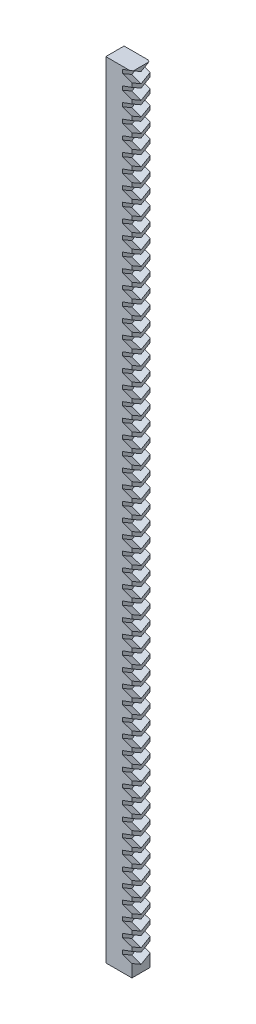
from build123d import *

# Parameters (mm, degrees)
SKETCH2_W           = 10
SKETCH2_H           = 300
BOSS_EXTRUDE2_DEPTH = 3.5
LPATTERN2_COUNT     = 54
LPATTERN2_PITCH     = 5.5


with BuildPart() as part:
    # Sketch2 → Boss-Extrude2 (new, symmetric)
    with BuildSketch(Plane.XY):
        with Locations((-3.25, 142.4726196)):
            Rectangle(SKETCH2_W, SKETCH2_H)
    extrude(amount=BOSS_EXTRUDE2_DEPTH, both=True)

    # Sketch4 → Cut-Loft1 section 0
    with BuildSketch(Plane.XY):
        with BuildLine():
            Line((1.75, -0.7374989), (-1.8, -2.0295932))
            Line((-1.8, -2.0295932), (-1.8, -3.4681939))
            Line((-1.8, -3.4681939), (1.75, -4.7602883))
            Line((1.75, -4.7602883), (1.75, -0.7374989))
        make_face()
    # Sketch6 → Cut-Loft1 section 1
    with BuildSketch(Plane(origin=(0, 2.020725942, 3.5), x_dir=(1, 0, 0), z_dir=(0, 0, 1))):
        with BuildLine():
            Line((1.75, -0.7374989), (-1.8, -2.0295932))
            Line((-1.8, -2.0295932), (-1.8, -3.4681939))
            Line((-1.8, -3.4681939), (1.75, -4.7602883))
            Line((1.75, -4.7602883), (1.75, -0.7374989))
        make_face()
    cut_loft1 = loft(mode=Mode.SUBTRACT)

    # Sketch4_3 → Cut-Loft2 section 0
    with BuildSketch(Plane.XY):
        with BuildLine():
            Line((1.75, -0.7374989), (-1.8, -2.0295932))
            Line((-1.8, -2.0295932), (-1.8, -3.4681939))
            Line((-1.8, -3.4681939), (1.75, -4.7602883))
            Line((1.75, -4.7602883), (1.75, -0.7374989))
        make_face()
    # Sketch7 → Cut-Loft2 section 1
    with BuildSketch(Plane(origin=(0, 2.020725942, -3.5), x_dir=(1, 0, 0), z_dir=(0, 0, 1))):
        with BuildLine():
            Line((1.75, -0.7374989), (-1.8, -2.0295932))
            Line((-1.8, -2.0295932), (-1.8, -3.4681939))
            Line((-1.8, -3.4681939), (1.75, -4.7602883))
            Line((1.75, -4.7602883), (1.75, -0.7374989))
        make_face()
    cut_loft2 = loft(mode=Mode.SUBTRACT)

    # LPattern2: Cut-Loft1, Cut-Loft2 ×54
    with Locations(*[(0, i * LPATTERN2_PITCH, 0) for i in range(1, LPATTERN2_COUNT)]):
        add(cut_loft1, mode=Mode.SUBTRACT)
        add(cut_loft2, mode=Mode.SUBTRACT)


solid = part.part
